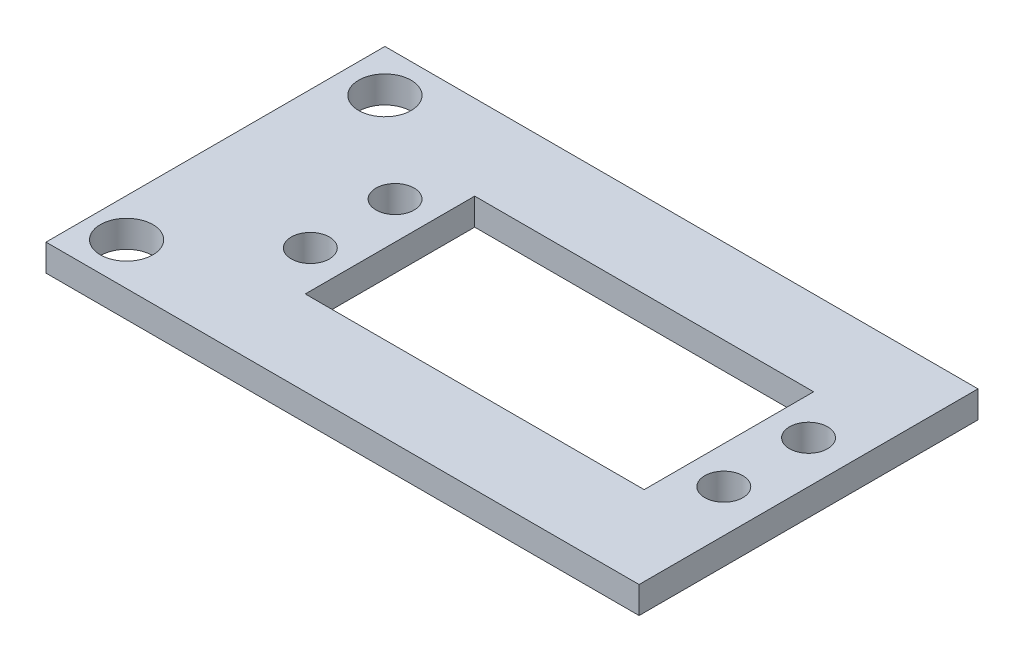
ISO-10303-21;
HEADER;
FILE_DESCRIPTION(('STEP AP214'),'2;1');
FILE_NAME('part.step','',(''),(''),'','','');
FILE_SCHEMA(('AUTOMOTIVE_DESIGN { 1 0 10303 214 1 1 1 1 }'));
ENDSEC;
DATA;
#1=APPLICATION_CONTEXT('core data for automotive mechanical design processes');
#2=APPLICATION_PROTOCOL_DEFINITION('international standard','automotive_design',2000,#1);
#3=PRODUCT_CONTEXT('',#1,'mechanical');
#4=PRODUCT('Part','Part','',(#3));
#5=PRODUCT_RELATED_PRODUCT_CATEGORY('part','',(#4));
#6=PRODUCT_DEFINITION_FORMATION('','',#4);
#7=PRODUCT_DEFINITION_CONTEXT('part definition',#1,'design');
#8=PRODUCT_DEFINITION('design','',#6,#7);
#9=PRODUCT_DEFINITION_SHAPE('','',#8);
#10=(LENGTH_UNIT() NAMED_UNIT(*) SI_UNIT(.MILLI.,.METRE.));
#11=(NAMED_UNIT(*) PLANE_ANGLE_UNIT() SI_UNIT($,.RADIAN.));
#12=(NAMED_UNIT(*) SI_UNIT($,.STERADIAN.) SOLID_ANGLE_UNIT());
#13=UNCERTAINTY_MEASURE_WITH_UNIT(LENGTH_MEASURE(1.E-05),#10,'distance_accuracy_value','');
#14=(GEOMETRIC_REPRESENTATION_CONTEXT(3) GLOBAL_UNCERTAINTY_ASSIGNED_CONTEXT((#13)) GLOBAL_UNIT_ASSIGNED_CONTEXT((#10,
#11,#12)) REPRESENTATION_CONTEXT('',''));
#15=CARTESIAN_POINT('',(0.,0.,0.));
#16=DIRECTION('',(0.,0.,1.));
#17=DIRECTION('',(1.,0.,0.));
#18=AXIS2_PLACEMENT_3D('',#15,#16,#17);
#19=CARTESIAN_POINT('',(0.,3.175,0.));
#20=DIRECTION('',(0.,1.,0.));
#21=DIRECTION('',(0.,0.,1.));
#22=AXIS2_PLACEMENT_3D('',#19,#20,#21);
#23=PLANE('',#22);
#24=CARTESIAN_POINT('',(-30.,3.175,-15.));
#25=DIRECTION('',(0.,1.,0.));
#26=DIRECTION('',(0.,0.,1.));
#27=AXIS2_PLACEMENT_3D('',#24,#25,#26);
#28=CIRCLE('',#27,3.1);
#29=CARTESIAN_POINT('',(-30.,3.175,-11.9));
#30=VERTEX_POINT('',#29);
#31=EDGE_CURVE('E140',#30,#30,#28,.T.);
#32=ORIENTED_EDGE('',*,*,#31,.F.);
#33=EDGE_LOOP('',(#32));
#34=FACE_BOUND('',#33,.T.);
#35=CARTESIAN_POINT('',(-18.8,3.175,5.));
#36=DIRECTION('',(0.,1.,0.));
#37=DIRECTION('',(0.,0.,1.));
#38=AXIS2_PLACEMENT_3D('',#35,#36,#37);
#39=CIRCLE('',#38,2.25);
#40=CARTESIAN_POINT('',(-18.8,3.175,7.25));
#41=VERTEX_POINT('',#40);
#42=EDGE_CURVE('E164',#41,#41,#39,.T.);
#43=ORIENTED_EDGE('',*,*,#42,.F.);
#44=EDGE_LOOP('',(#43));
#45=FACE_BOUND('',#44,.T.);
#46=CARTESIAN_POINT('',(-18.8,3.175,-5.));
#47=DIRECTION('',(0.,1.,0.));
#48=DIRECTION('',(0.,0.,1.));
#49=AXIS2_PLACEMENT_3D('',#46,#47,#48);
#50=CIRCLE('',#49,2.25);
#51=CARTESIAN_POINT('',(-18.8,3.175,-2.75));
#52=VERTEX_POINT('',#51);
#53=EDGE_CURVE('E180',#52,#52,#50,.T.);
#54=ORIENTED_EDGE('',*,*,#53,.F.);
#55=EDGE_LOOP('',(#54));
#56=FACE_BOUND('',#55,.T.);
#57=DIRECTION('',(0.,0.,1.));
#58=VECTOR('',#57,1.);
#59=CARTESIAN_POINT('',(-35.,3.175,20.));
#60=LINE('',#59,#58);
#61=CARTESIAN_POINT('',(-35.,3.175,-20.));
#62=VERTEX_POINT('',#61);
#63=CARTESIAN_POINT('',(-35.,3.175,20.));
#64=VERTEX_POINT('',#63);
#65=EDGE_CURVE('E188',#62,#64,#60,.T.);
#66=ORIENTED_EDGE('',*,*,#65,.T.);
#67=DIRECTION('',(1.,0.,0.));
#68=VECTOR('',#67,1.);
#69=CARTESIAN_POINT('',(35.,3.175,20.));
#70=LINE('',#69,#68);
#71=CARTESIAN_POINT('',(35.,3.175,20.));
#72=VERTEX_POINT('',#71);
#73=EDGE_CURVE('E192',#64,#72,#70,.T.);
#74=ORIENTED_EDGE('',*,*,#73,.T.);
#75=DIRECTION('',(0.,0.,-1.));
#76=VECTOR('',#75,1.);
#77=CARTESIAN_POINT('',(35.,3.175,20.));
#78=LINE('',#77,#76);
#79=CARTESIAN_POINT('',(35.,3.175,-20.));
#80=VERTEX_POINT('',#79);
#81=EDGE_CURVE('E196',#72,#80,#78,.T.);
#82=ORIENTED_EDGE('',*,*,#81,.T.);
#83=DIRECTION('',(-1.,0.,0.));
#84=VECTOR('',#83,1.);
#85=CARTESIAN_POINT('',(35.,3.175,-20.));
#86=LINE('',#85,#84);
#87=EDGE_CURVE('E199',#80,#62,#86,.T.);
#88=ORIENTED_EDGE('',*,*,#87,.T.);
#89=EDGE_LOOP('',(#66,#74,#82,#88));
#90=FACE_BOUND('',#89,.T.);
#91=CARTESIAN_POINT('',(30.,3.175,-5.));
#92=DIRECTION('',(0.,1.,0.));
#93=DIRECTION('',(0.,0.,1.));
#94=AXIS2_PLACEMENT_3D('',#91,#92,#93);
#95=CIRCLE('',#94,2.25000000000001);
#96=CARTESIAN_POINT('',(30.,3.175,-2.75));
#97=VERTEX_POINT('',#96);
#98=EDGE_CURVE('E172',#97,#97,#95,.T.);
#99=ORIENTED_EDGE('',*,*,#98,.F.);
#100=EDGE_LOOP('',(#99));
#101=FACE_BOUND('',#100,.T.);
#102=CARTESIAN_POINT('',(30.,3.175,5.));
#103=DIRECTION('',(0.,1.,0.));
#104=DIRECTION('',(0.,0.,1.));
#105=AXIS2_PLACEMENT_3D('',#102,#103,#104);
#106=CIRCLE('',#105,2.25000000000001);
#107=CARTESIAN_POINT('',(30.,3.175,7.25000000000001));
#108=VERTEX_POINT('',#107);
#109=EDGE_CURVE('E156',#108,#108,#106,.T.);
#110=ORIENTED_EDGE('',*,*,#109,.F.);
#111=EDGE_LOOP('',(#110));
#112=FACE_BOUND('',#111,.T.);
#113=DIRECTION('',(1.,0.,0.));
#114=VECTOR('',#113,1.);
#115=CARTESIAN_POINT('',(25.6,3.175,10.));
#116=LINE('',#115,#114);
#117=CARTESIAN_POINT('',(-14.4,3.175,10.));
#118=VERTEX_POINT('',#117);
#119=CARTESIAN_POINT('',(25.6,3.175,10.));
#120=VERTEX_POINT('',#119);
#121=EDGE_CURVE('E114',#118,#120,#116,.T.);
#122=ORIENTED_EDGE('',*,*,#121,.F.);
#123=DIRECTION('',(0.,0.,1.));
#124=VECTOR('',#123,1.);
#125=CARTESIAN_POINT('',(-14.4,3.175,10.));
#126=LINE('',#125,#124);
#127=CARTESIAN_POINT('',(-14.4,3.175,-9.99999999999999));
#128=VERTEX_POINT('',#127);
#129=EDGE_CURVE('E105',#128,#118,#126,.T.);
#130=ORIENTED_EDGE('',*,*,#129,.F.);
#131=DIRECTION('',(-1.,0.,0.));
#132=VECTOR('',#131,1.);
#133=CARTESIAN_POINT('',(25.6,3.175,-10.));
#134=LINE('',#133,#132);
#135=CARTESIAN_POINT('',(25.6,3.175,-10.));
#136=VERTEX_POINT('',#135);
#137=EDGE_CURVE('E132',#136,#128,#134,.T.);
#138=ORIENTED_EDGE('',*,*,#137,.F.);
#139=DIRECTION('',(0.,0.,-1.));
#140=VECTOR('',#139,1.);
#141=CARTESIAN_POINT('',(25.6,3.175,10.));
#142=LINE('',#141,#140);
#143=EDGE_CURVE('E128',#120,#136,#142,.T.);
#144=ORIENTED_EDGE('',*,*,#143,.F.);
#145=EDGE_LOOP('',(#122,#130,#138,#144));
#146=FACE_BOUND('',#145,.T.);
#147=CARTESIAN_POINT('',(-30.4866670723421,3.175,15.));
#148=DIRECTION('',(0.,1.,0.));
#149=DIRECTION('',(0.,0.,1.));
#150=AXIS2_PLACEMENT_3D('',#147,#148,#149);
#151=CIRCLE('',#150,3.1);
#152=CARTESIAN_POINT('',(-30.4866670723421,3.175,18.1));
#153=VERTEX_POINT('',#152);
#154=EDGE_CURVE('E314',#153,#153,#151,.T.);
#155=ORIENTED_EDGE('',*,*,#154,.F.);
#156=EDGE_LOOP('',(#155));
#157=FACE_BOUND('',#156,.T.);
#158=ADVANCED_FACE('F39',(#34,#45,#56,#90,#101,#112,#146,#157),#23,.T.);
#159=CARTESIAN_POINT('',(0.,0.,0.));
#160=DIRECTION('',(0.,1.,0.));
#161=DIRECTION('',(0.,0.,1.));
#162=AXIS2_PLACEMENT_3D('',#159,#160,#161);
#163=PLANE('',#162);
#164=CARTESIAN_POINT('',(30.,0.,5.));
#165=DIRECTION('',(0.,1.,0.));
#166=DIRECTION('',(0.,0.,1.));
#167=AXIS2_PLACEMENT_3D('',#164,#165,#166);
#168=CIRCLE('',#167,2.25000000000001);
#169=CARTESIAN_POINT('',(30.,0.,7.25000000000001));
#170=VERTEX_POINT('',#169);
#171=EDGE_CURVE('E123',#170,#170,#168,.T.);
#172=ORIENTED_EDGE('',*,*,#171,.T.);
#173=EDGE_LOOP('',(#172));
#174=FACE_BOUND('',#173,.T.);
#175=CARTESIAN_POINT('',(-18.8,0.,5.));
#176=DIRECTION('',(0.,1.,0.));
#177=DIRECTION('',(0.,0.,1.));
#178=AXIS2_PLACEMENT_3D('',#175,#176,#177);
#179=CIRCLE('',#178,2.25);
#180=CARTESIAN_POINT('',(-18.8,0.,7.25));
#181=VERTEX_POINT('',#180);
#182=EDGE_CURVE('E160',#181,#181,#179,.T.);
#183=ORIENTED_EDGE('',*,*,#182,.T.);
#184=EDGE_LOOP('',(#183));
#185=FACE_BOUND('',#184,.T.);
#186=CARTESIAN_POINT('',(30.,0.,-5.));
#187=DIRECTION('',(0.,1.,0.));
#188=DIRECTION('',(0.,0.,1.));
#189=AXIS2_PLACEMENT_3D('',#186,#187,#188);
#190=CIRCLE('',#189,2.25000000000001);
#191=CARTESIAN_POINT('',(30.,0.,-2.75));
#192=VERTEX_POINT('',#191);
#193=EDGE_CURVE('E168',#192,#192,#190,.T.);
#194=ORIENTED_EDGE('',*,*,#193,.T.);
#195=EDGE_LOOP('',(#194));
#196=FACE_BOUND('',#195,.T.);
#197=CARTESIAN_POINT('',(-18.8,0.,-5.));
#198=DIRECTION('',(0.,1.,0.));
#199=DIRECTION('',(0.,0.,1.));
#200=AXIS2_PLACEMENT_3D('',#197,#198,#199);
#201=CIRCLE('',#200,2.25);
#202=CARTESIAN_POINT('',(-18.8,0.,-2.75));
#203=VERTEX_POINT('',#202);
#204=EDGE_CURVE('E176',#203,#203,#201,.T.);
#205=ORIENTED_EDGE('',*,*,#204,.T.);
#206=EDGE_LOOP('',(#205));
#207=FACE_BOUND('',#206,.T.);
#208=DIRECTION('',(0.,0.,1.));
#209=VECTOR('',#208,1.);
#210=CARTESIAN_POINT('',(-35.,0.,20.));
#211=LINE('',#210,#209);
#212=CARTESIAN_POINT('',(-35.,0.,-20.));
#213=VERTEX_POINT('',#212);
#214=CARTESIAN_POINT('',(-35.,0.,20.));
#215=VERTEX_POINT('',#214);
#216=EDGE_CURVE('E184',#213,#215,#211,.T.);
#217=ORIENTED_EDGE('',*,*,#216,.F.);
#218=DIRECTION('',(-1.,0.,0.));
#219=VECTOR('',#218,1.);
#220=CARTESIAN_POINT('',(35.,0.,-20.));
#221=LINE('',#220,#219);
#222=CARTESIAN_POINT('',(35.,0.,-20.));
#223=VERTEX_POINT('',#222);
#224=EDGE_CURVE('E193',#223,#213,#221,.T.);
#225=ORIENTED_EDGE('',*,*,#224,.F.);
#226=DIRECTION('',(0.,0.,-1.));
#227=VECTOR('',#226,1.);
#228=CARTESIAN_POINT('',(35.,0.,20.));
#229=LINE('',#228,#227);
#230=CARTESIAN_POINT('',(35.,0.,20.));
#231=VERTEX_POINT('',#230);
#232=EDGE_CURVE('E209',#231,#223,#229,.T.);
#233=ORIENTED_EDGE('',*,*,#232,.F.);
#234=DIRECTION('',(1.,0.,0.));
#235=VECTOR('',#234,1.);
#236=CARTESIAN_POINT('',(35.,0.,20.));
#237=LINE('',#236,#235);
#238=EDGE_CURVE('E206',#215,#231,#237,.T.);
#239=ORIENTED_EDGE('',*,*,#238,.F.);
#240=EDGE_LOOP('',(#217,#225,#233,#239));
#241=FACE_BOUND('',#240,.T.);
#242=DIRECTION('',(0.,0.,1.));
#243=VECTOR('',#242,1.);
#244=CARTESIAN_POINT('',(-14.4,0.,10.));
#245=LINE('',#244,#243);
#246=CARTESIAN_POINT('',(-14.4,0.,-9.99999999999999));
#247=VERTEX_POINT('',#246);
#248=CARTESIAN_POINT('',(-14.4,0.,10.));
#249=VERTEX_POINT('',#248);
#250=EDGE_CURVE('E63',#247,#249,#245,.T.);
#251=ORIENTED_EDGE('',*,*,#250,.T.);
#252=DIRECTION('',(1.,0.,0.));
#253=VECTOR('',#252,1.);
#254=CARTESIAN_POINT('',(25.6,0.,10.));
#255=LINE('',#254,#253);
#256=CARTESIAN_POINT('',(25.6,0.,10.));
#257=VERTEX_POINT('',#256);
#258=EDGE_CURVE('E121',#249,#257,#255,.T.);
#259=ORIENTED_EDGE('',*,*,#258,.T.);
#260=DIRECTION('',(0.,0.,-1.));
#261=VECTOR('',#260,1.);
#262=CARTESIAN_POINT('',(25.6,0.,10.));
#263=LINE('',#262,#261);
#264=CARTESIAN_POINT('',(25.6,0.,-10.));
#265=VERTEX_POINT('',#264);
#266=EDGE_CURVE('E143',#257,#265,#263,.T.);
#267=ORIENTED_EDGE('',*,*,#266,.T.);
#268=DIRECTION('',(-1.,0.,0.));
#269=VECTOR('',#268,1.);
#270=CARTESIAN_POINT('',(25.6,0.,-10.));
#271=LINE('',#270,#269);
#272=EDGE_CURVE('E115',#265,#247,#271,.T.);
#273=ORIENTED_EDGE('',*,*,#272,.T.);
#274=EDGE_LOOP('',(#251,#259,#267,#273));
#275=FACE_BOUND('',#274,.T.);
#276=CARTESIAN_POINT('',(-30.,0.,-15.));
#277=DIRECTION('',(0.,1.,0.));
#278=DIRECTION('',(0.,0.,1.));
#279=AXIS2_PLACEMENT_3D('',#276,#277,#278);
#280=CIRCLE('',#279,3.1);
#281=CARTESIAN_POINT('',(-30.,0.,-11.9));
#282=VERTEX_POINT('',#281);
#283=EDGE_CURVE('E322',#282,#282,#280,.T.);
#284=ORIENTED_EDGE('',*,*,#283,.T.);
#285=EDGE_LOOP('',(#284));
#286=FACE_BOUND('',#285,.T.);
#287=CARTESIAN_POINT('',(-30.4866670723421,0.,15.));
#288=DIRECTION('',(0.,1.,0.));
#289=DIRECTION('',(0.,0.,1.));
#290=AXIS2_PLACEMENT_3D('',#287,#288,#289);
#291=CIRCLE('',#290,3.1);
#292=CARTESIAN_POINT('',(-30.4866670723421,0.,18.1));
#293=VERTEX_POINT('',#292);
#294=EDGE_CURVE('E317',#293,#293,#291,.T.);
#295=ORIENTED_EDGE('',*,*,#294,.T.);
#296=EDGE_LOOP('',(#295));
#297=FACE_BOUND('',#296,.T.);
#298=ADVANCED_FACE('F232',(#174,#185,#196,#207,#241,#275,#286,#297),#163,.F.);
#299=CARTESIAN_POINT('',(-35.,3.175,20.));
#300=DIRECTION('',(1.,0.,0.));
#301=DIRECTION('',(0.,0.,-1.));
#302=AXIS2_PLACEMENT_3D('',#299,#300,#301);
#303=PLANE('',#302);
#304=ORIENTED_EDGE('',*,*,#216,.T.);
#305=DIRECTION('',(0.,-1.,0.));
#306=VECTOR('',#305,1.);
#307=CARTESIAN_POINT('',(-35.,3.175,20.));
#308=LINE('',#307,#306);
#309=EDGE_CURVE('E11',#64,#215,#308,.T.);
#310=ORIENTED_EDGE('',*,*,#309,.F.);
#311=ORIENTED_EDGE('',*,*,#65,.F.);
#312=DIRECTION('',(0.,-1.,0.));
#313=VECTOR('',#312,1.);
#314=CARTESIAN_POINT('',(-35.,3.175,-20.));
#315=LINE('',#314,#313);
#316=EDGE_CURVE('E202',#62,#213,#315,.T.);
#317=ORIENTED_EDGE('',*,*,#316,.T.);
#318=EDGE_LOOP('',(#304,#310,#311,#317));
#319=FACE_BOUND('',#318,.T.);
#320=ADVANCED_FACE('F41',(#319),#303,.F.);
#321=CARTESIAN_POINT('',(35.,3.175,20.));
#322=DIRECTION('',(0.,0.,-1.));
#323=DIRECTION('',(-1.,0.,0.));
#324=AXIS2_PLACEMENT_3D('',#321,#322,#323);
#325=PLANE('',#324);
#326=ORIENTED_EDGE('',*,*,#238,.T.);
#327=DIRECTION('',(0.,-1.,0.));
#328=VECTOR('',#327,1.);
#329=CARTESIAN_POINT('',(35.,3.175,20.));
#330=LINE('',#329,#328);
#331=EDGE_CURVE('E48',#72,#231,#330,.T.);
#332=ORIENTED_EDGE('',*,*,#331,.F.);
#333=ORIENTED_EDGE('',*,*,#73,.F.);
#334=ORIENTED_EDGE('',*,*,#309,.T.);
#335=EDGE_LOOP('',(#326,#332,#333,#334));
#336=FACE_BOUND('',#335,.T.);
#337=ADVANCED_FACE('F243',(#336),#325,.F.);
#338=CARTESIAN_POINT('',(35.,3.175,20.));
#339=DIRECTION('',(-1.,0.,0.));
#340=DIRECTION('',(0.,0.,1.));
#341=AXIS2_PLACEMENT_3D('',#338,#339,#340);
#342=PLANE('',#341);
#343=ORIENTED_EDGE('',*,*,#232,.T.);
#344=DIRECTION('',(0.,-1.,0.));
#345=VECTOR('',#344,1.);
#346=CARTESIAN_POINT('',(35.,3.175,-20.));
#347=LINE('',#346,#345);
#348=EDGE_CURVE('E217',#80,#223,#347,.T.);
#349=ORIENTED_EDGE('',*,*,#348,.F.);
#350=ORIENTED_EDGE('',*,*,#81,.F.);
#351=ORIENTED_EDGE('',*,*,#331,.T.);
#352=EDGE_LOOP('',(#343,#349,#350,#351));
#353=FACE_BOUND('',#352,.T.);
#354=ADVANCED_FACE('F226',(#353),#342,.F.);
#355=CARTESIAN_POINT('',(35.,3.175,-20.));
#356=DIRECTION('',(0.,0.,1.));
#357=DIRECTION('',(1.,0.,0.));
#358=AXIS2_PLACEMENT_3D('',#355,#356,#357);
#359=PLANE('',#358);
#360=ORIENTED_EDGE('',*,*,#224,.T.);
#361=ORIENTED_EDGE('',*,*,#316,.F.);
#362=ORIENTED_EDGE('',*,*,#87,.F.);
#363=ORIENTED_EDGE('',*,*,#348,.T.);
#364=EDGE_LOOP('',(#360,#361,#362,#363));
#365=FACE_BOUND('',#364,.T.);
#366=ADVANCED_FACE('F236',(#365),#359,.F.);
#367=CARTESIAN_POINT('',(-18.8,3.175,-5.));
#368=DIRECTION('',(0.,-1.,0.));
#369=DIRECTION('',(0.,0.,-1.));
#370=AXIS2_PLACEMENT_3D('',#367,#368,#369);
#371=CYLINDRICAL_SURFACE('',#370,2.25);
#372=ORIENTED_EDGE('',*,*,#53,.T.);
#373=EDGE_LOOP('',(#372));
#374=FACE_BOUND('',#373,.T.);
#375=ORIENTED_EDGE('',*,*,#204,.F.);
#376=EDGE_LOOP('',(#375));
#377=FACE_BOUND('',#376,.T.);
#378=ADVANCED_FACE('F261',(#374,#377),#371,.F.);
#379=CARTESIAN_POINT('',(30.,3.175,-5.));
#380=DIRECTION('',(0.,-1.,0.));
#381=DIRECTION('',(0.,0.,-1.));
#382=AXIS2_PLACEMENT_3D('',#379,#380,#381);
#383=CYLINDRICAL_SURFACE('',#382,2.25000000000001);
#384=ORIENTED_EDGE('',*,*,#98,.T.);
#385=EDGE_LOOP('',(#384));
#386=FACE_BOUND('',#385,.T.);
#387=ORIENTED_EDGE('',*,*,#193,.F.);
#388=EDGE_LOOP('',(#387));
#389=FACE_BOUND('',#388,.T.);
#390=ADVANCED_FACE('F268',(#386,#389),#383,.F.);
#391=CARTESIAN_POINT('',(-18.8,3.175,5.));
#392=DIRECTION('',(0.,-1.,0.));
#393=DIRECTION('',(0.,0.,-1.));
#394=AXIS2_PLACEMENT_3D('',#391,#392,#393);
#395=CYLINDRICAL_SURFACE('',#394,2.25);
#396=ORIENTED_EDGE('',*,*,#42,.T.);
#397=EDGE_LOOP('',(#396));
#398=FACE_BOUND('',#397,.T.);
#399=ORIENTED_EDGE('',*,*,#182,.F.);
#400=EDGE_LOOP('',(#399));
#401=FACE_BOUND('',#400,.T.);
#402=ADVANCED_FACE('F273',(#398,#401),#395,.F.);
#403=CARTESIAN_POINT('',(30.,3.175,5.));
#404=DIRECTION('',(0.,-1.,0.));
#405=DIRECTION('',(0.,0.,-1.));
#406=AXIS2_PLACEMENT_3D('',#403,#404,#405);
#407=CYLINDRICAL_SURFACE('',#406,2.25000000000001);
#408=ORIENTED_EDGE('',*,*,#109,.T.);
#409=EDGE_LOOP('',(#408));
#410=FACE_BOUND('',#409,.T.);
#411=ORIENTED_EDGE('',*,*,#171,.F.);
#412=EDGE_LOOP('',(#411));
#413=FACE_BOUND('',#412,.T.);
#414=ADVANCED_FACE('F283',(#410,#413),#407,.F.);
#415=CARTESIAN_POINT('',(-14.4,3.175,10.));
#416=DIRECTION('',(1.,0.,0.));
#417=DIRECTION('',(0.,0.,-1.));
#418=AXIS2_PLACEMENT_3D('',#415,#416,#417);
#419=PLANE('',#418);
#420=ORIENTED_EDGE('',*,*,#250,.F.);
#421=DIRECTION('',(0.,-1.,0.));
#422=VECTOR('',#421,1.);
#423=CARTESIAN_POINT('',(-14.4,3.175,-9.99999999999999));
#424=LINE('',#423,#422);
#425=EDGE_CURVE('E109',#128,#247,#424,.T.);
#426=ORIENTED_EDGE('',*,*,#425,.F.);
#427=ORIENTED_EDGE('',*,*,#129,.T.);
#428=DIRECTION('',(0.,-1.,0.));
#429=VECTOR('',#428,1.);
#430=CARTESIAN_POINT('',(-14.4,3.175,10.));
#431=LINE('',#430,#429);
#432=EDGE_CURVE('E108',#118,#249,#431,.T.);
#433=ORIENTED_EDGE('',*,*,#432,.T.);
#434=EDGE_LOOP('',(#420,#426,#427,#433));
#435=FACE_BOUND('',#434,.T.);
#436=ADVANCED_FACE('F107',(#435),#419,.T.);
#437=CARTESIAN_POINT('',(25.6,3.175,10.));
#438=DIRECTION('',(0.,0.,-1.));
#439=DIRECTION('',(-1.,0.,0.));
#440=AXIS2_PLACEMENT_3D('',#437,#438,#439);
#441=PLANE('',#440);
#442=ORIENTED_EDGE('',*,*,#258,.F.);
#443=ORIENTED_EDGE('',*,*,#432,.F.);
#444=ORIENTED_EDGE('',*,*,#121,.T.);
#445=DIRECTION('',(0.,-1.,0.));
#446=VECTOR('',#445,1.);
#447=CARTESIAN_POINT('',(25.6,3.175,10.));
#448=LINE('',#447,#446);
#449=EDGE_CURVE('E124',#120,#257,#448,.T.);
#450=ORIENTED_EDGE('',*,*,#449,.T.);
#451=EDGE_LOOP('',(#442,#443,#444,#450));
#452=FACE_BOUND('',#451,.T.);
#453=ADVANCED_FACE('F118',(#452),#441,.T.);
#454=CARTESIAN_POINT('',(25.6,3.175,10.));
#455=DIRECTION('',(-1.,0.,0.));
#456=DIRECTION('',(0.,0.,1.));
#457=AXIS2_PLACEMENT_3D('',#454,#455,#456);
#458=PLANE('',#457);
#459=ORIENTED_EDGE('',*,*,#266,.F.);
#460=ORIENTED_EDGE('',*,*,#449,.F.);
#461=ORIENTED_EDGE('',*,*,#143,.T.);
#462=DIRECTION('',(0.,-1.,0.));
#463=VECTOR('',#462,1.);
#464=CARTESIAN_POINT('',(25.6,3.175,-10.));
#465=LINE('',#464,#463);
#466=EDGE_CURVE('E55',#136,#265,#465,.T.);
#467=ORIENTED_EDGE('',*,*,#466,.T.);
#468=EDGE_LOOP('',(#459,#460,#461,#467));
#469=FACE_BOUND('',#468,.T.);
#470=ADVANCED_FACE('F295',(#469),#458,.T.);
#471=CARTESIAN_POINT('',(25.6,3.175,-10.));
#472=DIRECTION('',(0.,0.,1.));
#473=DIRECTION('',(1.,0.,0.));
#474=AXIS2_PLACEMENT_3D('',#471,#472,#473);
#475=PLANE('',#474);
#476=ORIENTED_EDGE('',*,*,#272,.F.);
#477=ORIENTED_EDGE('',*,*,#466,.F.);
#478=ORIENTED_EDGE('',*,*,#137,.T.);
#479=ORIENTED_EDGE('',*,*,#425,.T.);
#480=EDGE_LOOP('',(#476,#477,#478,#479));
#481=FACE_BOUND('',#480,.T.);
#482=ADVANCED_FACE('F298',(#481),#475,.T.);
#483=CARTESIAN_POINT('',(-30.,3.175,-15.));
#484=DIRECTION('',(0.,-1.,0.));
#485=DIRECTION('',(0.,0.,-1.));
#486=AXIS2_PLACEMENT_3D('',#483,#484,#485);
#487=CYLINDRICAL_SURFACE('',#486,3.1);
#488=ORIENTED_EDGE('',*,*,#31,.T.);
#489=EDGE_LOOP('',(#488));
#490=FACE_BOUND('',#489,.T.);
#491=ORIENTED_EDGE('',*,*,#283,.F.);
#492=EDGE_LOOP('',(#491));
#493=FACE_BOUND('',#492,.T.);
#494=ADVANCED_FACE('F302',(#490,#493),#487,.F.);
#495=CARTESIAN_POINT('',(-30.4866670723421,3.175,15.));
#496=DIRECTION('',(0.,-1.,0.));
#497=DIRECTION('',(0.,0.,-1.));
#498=AXIS2_PLACEMENT_3D('',#495,#496,#497);
#499=CYLINDRICAL_SURFACE('',#498,3.1);
#500=ORIENTED_EDGE('',*,*,#154,.T.);
#501=EDGE_LOOP('',(#500));
#502=FACE_BOUND('',#501,.T.);
#503=ORIENTED_EDGE('',*,*,#294,.F.);
#504=EDGE_LOOP('',(#503));
#505=FACE_BOUND('',#504,.T.);
#506=ADVANCED_FACE('F305',(#502,#505),#499,.F.);
#507=CLOSED_SHELL('',(#158,#298,#320,#337,#354,#366,#378,#390,#402,#414,#436,#453,#470,#482,
#494,#506));
#508=MANIFOLD_SOLID_BREP('B2',#507);
#509=ADVANCED_BREP_SHAPE_REPRESENTATION('',(#18,#508),#14);
#510=SHAPE_DEFINITION_REPRESENTATION(#9,#509);
ENDSEC;
END-ISO-10303-21;
